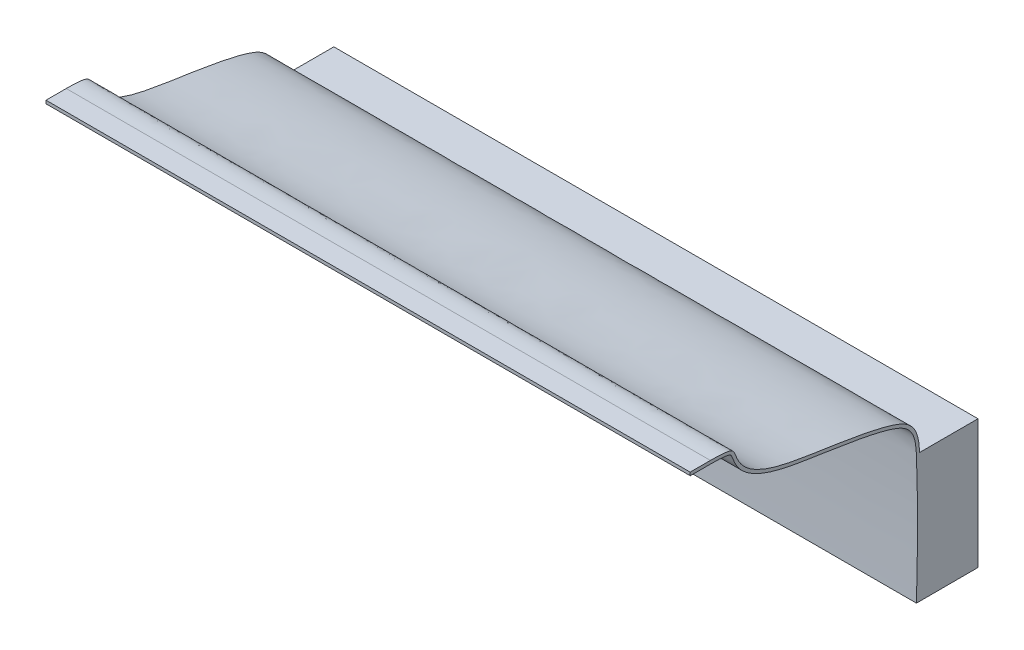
ISO-10303-21;
HEADER;
FILE_DESCRIPTION(('STEP AP214'),'2;1');
FILE_NAME('part.step','',(''),(''),'','','');
FILE_SCHEMA(('AUTOMOTIVE_DESIGN { 1 0 10303 214 1 1 1 1 }'));
ENDSEC;
DATA;
#1=APPLICATION_CONTEXT('core data for automotive mechanical design processes');
#2=APPLICATION_PROTOCOL_DEFINITION('international standard','automotive_design',2000,#1);
#3=PRODUCT_CONTEXT('',#1,'mechanical');
#4=PRODUCT('Part','Part','',(#3));
#5=PRODUCT_RELATED_PRODUCT_CATEGORY('part','',(#4));
#6=PRODUCT_DEFINITION_FORMATION('','',#4);
#7=PRODUCT_DEFINITION_CONTEXT('part definition',#1,'design');
#8=PRODUCT_DEFINITION('design','',#6,#7);
#9=PRODUCT_DEFINITION_SHAPE('','',#8);
#10=(LENGTH_UNIT() NAMED_UNIT(*) SI_UNIT(.MILLI.,.METRE.));
#11=(NAMED_UNIT(*) PLANE_ANGLE_UNIT() SI_UNIT($,.RADIAN.));
#12=(NAMED_UNIT(*) SI_UNIT($,.STERADIAN.) SOLID_ANGLE_UNIT());
#13=UNCERTAINTY_MEASURE_WITH_UNIT(LENGTH_MEASURE(1.E-05),#10,'distance_accuracy_value','');
#14=(GEOMETRIC_REPRESENTATION_CONTEXT(3) GLOBAL_UNCERTAINTY_ASSIGNED_CONTEXT((#13)) GLOBAL_UNIT_ASSIGNED_CONTEXT((#10,
#11,#12)) REPRESENTATION_CONTEXT('',''));
#15=CARTESIAN_POINT('',(0.,0.,0.));
#16=DIRECTION('',(0.,0.,1.));
#17=DIRECTION('',(1.,0.,0.));
#18=AXIS2_PLACEMENT_3D('',#15,#16,#17);
#19=CARTESIAN_POINT('',(-20.3320316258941,5.08,-2.3));
#20=DIRECTION('',(1.,0.,0.));
#21=DIRECTION('',(0.,0.,-1.));
#22=AXIS2_PLACEMENT_3D('',#19,#20,#21);
#23=PLANE('',#22);
#24=DIRECTION('',(0.,0.,1.));
#25=VECTOR('',#24,1.);
#26=CARTESIAN_POINT('',(-20.3320316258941,0.,-2.3));
#27=LINE('',#26,#25);
#28=CARTESIAN_POINT('',(-20.3320316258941,0.,-2.3));
#29=VERTEX_POINT('',#28);
#30=CARTESIAN_POINT('',(-20.3320316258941,-0.00216862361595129,-5.4829838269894E-05));
#31=VERTEX_POINT('',#30);
#32=EDGE_CURVE('E466',#29,#31,#27,.T.);
#33=ORIENTED_EDGE('',*,*,#32,.T.);
#34=CARTESIAN_POINT('',(-20.3320316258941,0.,0.));
#35=DIRECTION('',(0.,0.,1.));
#36=VECTOR('',#35,1.);
#37=LINE('',#34,#36);
#38=CARTESIAN_POINT('',(-20.3320316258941,-0.00444429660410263,0.126999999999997));
#39=VERTEX_POINT('',#38);
#40=EDGE_CURVE('E159',#31,#39,#37,.T.);
#41=ORIENTED_EDGE('',*,*,#40,.T.);
#42=CARTESIAN_POINT('',(-20.3320316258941,-0.00888859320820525,0.126999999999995));
#43=CARTESIAN_POINT('',(-20.3320316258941,1.04828765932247,0.100624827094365));
#44=CARTESIAN_POINT('',(-20.3320316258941,2.5980749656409,0.0619596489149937));
#45=CARTESIAN_POINT('',(-20.3320316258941,4.4512386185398,0.104012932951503));
#46=CARTESIAN_POINT('',(-20.3320316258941,5.11061033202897,0.128590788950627));
#47=CARTESIAN_POINT('',(-20.3320316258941,5.25979811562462,0.136443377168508));
#48=CARTESIAN_POINT('',(-20.3320316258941,5.48323742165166,0.162819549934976));
#49=CARTESIAN_POINT('',(-20.3320316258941,5.71146449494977,0.219765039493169));
#50=CARTESIAN_POINT('',(-20.3320316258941,5.89613270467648,0.302073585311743));
#51=CARTESIAN_POINT('',(-20.3320316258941,6.04656290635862,0.411828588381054));
#52=CARTESIAN_POINT('',(-20.3320316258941,6.17276414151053,0.554588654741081));
#53=CARTESIAN_POINT('',(-20.3320316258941,6.31363642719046,0.790668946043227));
#54=CARTESIAN_POINT('',(-20.3320316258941,6.4116182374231,1.05820065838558));
#55=CARTESIAN_POINT('',(-20.3320316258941,6.51958911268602,1.43653434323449));
#56=CARTESIAN_POINT('',(-20.3320316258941,6.62566805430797,1.87329890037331));
#57=CARTESIAN_POINT('',(-20.3320316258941,6.75146574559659,2.52942411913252));
#58=CARTESIAN_POINT('',(-20.3320316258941,6.86508798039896,3.22590130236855));
#59=CARTESIAN_POINT('',(-20.3320316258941,6.98973839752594,4.06547665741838));
#60=CARTESIAN_POINT('',(-20.3320316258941,7.1118509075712,4.86043553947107));
#61=CARTESIAN_POINT('',(-20.3320316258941,7.23328625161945,5.42840675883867));
#62=CARTESIAN_POINT('',(-20.3320316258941,7.32142250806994,5.77613720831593));
#63=CARTESIAN_POINT('',(-20.3320316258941,7.43374339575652,6.12919048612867));
#64=CARTESIAN_POINT('',(-20.3320316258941,7.59075244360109,6.48874219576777));
#65=CARTESIAN_POINT('',(-20.3320316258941,7.75779148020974,6.76888539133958));
#66=CARTESIAN_POINT('',(-20.3320316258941,7.93123039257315,6.98136442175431));
#67=CARTESIAN_POINT('',(-20.3320316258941,8.10668940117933,7.1373884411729));
#68=CARTESIAN_POINT('',(-20.3320316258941,8.26642460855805,7.24056093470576));
#69=CARTESIAN_POINT('',(-20.3320316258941,8.40707869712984,7.31079667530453));
#70=CARTESIAN_POINT('',(-20.3320316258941,8.52459324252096,7.36033679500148));
#71=CARTESIAN_POINT('',(-20.3320316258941,8.60685478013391,7.39269457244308));
#72=CARTESIAN_POINT('',(-20.3320316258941,8.66333806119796,7.41718960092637));
#73=CARTESIAN_POINT('',(-20.3320316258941,8.70628545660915,7.43583085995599));
#74=CARTESIAN_POINT('',(-20.3320316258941,8.74366529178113,7.48965231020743));
#75=CARTESIAN_POINT('',(-20.3320316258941,8.78171981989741,7.67142372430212));
#76=CARTESIAN_POINT('',(-20.3320316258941,8.80064792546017,7.89779483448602));
#77=CARTESIAN_POINT('',(-20.3320316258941,8.8055926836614,8.11617673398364));
#78=CARTESIAN_POINT('',(-20.3320316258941,8.805741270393,8.24476670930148));
#79=B_SPLINE_CURVE_WITH_KNOTS('',3,(#42,#43,#44,#45,#46,#47,#48,#49,#50,#51,#52,#53,#54,#55,#56,
#57,#58,#59,#60,#61,#62,#63,#64,#65,#66,#67,#68,#69,#70,#71,#72,#73,#74,#75,#76,#77,#78),
.UNSPECIFIED.,.F.,.F.,(4,1,2,1,1,1,1,1,1,1,1,1,1,1,1,1,1,1,1,1,1,1,1,1,1,1,1,1,1,1,1,1,1,4),(0.,
0.25,0.366492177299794,0.374999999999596,0.395833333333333,0.416666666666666,0.4375,
0.458333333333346,0.479166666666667,0.5,0.5392,0.546971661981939,0.5784,0.6176,0.64193063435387,
0.6638,0.71,0.725421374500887,0.733571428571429,0.757142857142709,0.780714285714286,
0.804285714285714,0.827857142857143,0.851428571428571,0.874999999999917,0.89375,0.9125,0.93125,
0.934791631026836,0.95,0.96875,0.979166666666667,0.989583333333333,1.),.UNSPECIFIED.);
#80=CARTESIAN_POINT('',(-20.3320316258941,8.80563656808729,8.24920977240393));
#81=VERTEX_POINT('',#80);
#82=EDGE_CURVE('E151',#39,#81,#79,.T.);
#83=ORIENTED_EDGE('',*,*,#82,.T.);
#84=CARTESIAN_POINT('',(-20.3320316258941,8.80563656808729,8.24920977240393));
#85=DIRECTION('',(0.,0.,1.));
#86=VECTOR('',#85,1.);
#87=LINE('',#84,#86);
#88=CARTESIAN_POINT('',(-20.3320316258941,8.80563656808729,9.04651660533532));
#89=VERTEX_POINT('',#88);
#90=EDGE_CURVE('E127',#81,#89,#87,.T.);
#91=ORIENTED_EDGE('',*,*,#90,.T.);
#92=CARTESIAN_POINT('',(-20.3320316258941,8.93249661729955,9.0539516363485));
#93=DIRECTION('',(-1.09273919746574E-13,-0.999722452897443,-0.023558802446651));
#94=VECTOR('',#93,1.);
#95=LINE('',#92,#94);
#96=CARTESIAN_POINT('',(-20.3320316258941,8.93260131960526,9.04950857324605));
#97=VERTEX_POINT('',#96);
#98=EDGE_CURVE('E389',#97,#89,#95,.T.);
#99=ORIENTED_EDGE('',*,*,#98,.F.);
#100=CARTESIAN_POINT('',(-20.3320316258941,8.93270602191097,8.25220174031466));
#101=DIRECTION('',(0.,0.,1.));
#102=VECTOR('',#101,1.);
#103=LINE('',#100,#102);
#104=CARTESIAN_POINT('',(-20.3320316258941,8.93260131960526,8.25220174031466));
#105=VERTEX_POINT('',#104);
#106=EDGE_CURVE('E142',#105,#97,#103,.T.);
#107=ORIENTED_EDGE('',*,*,#106,.F.);
#108=CARTESIAN_POINT('',(-20.3320316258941,-0.00888859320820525,0.));
#109=CARTESIAN_POINT('',(-20.3320316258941,1.05510279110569,-0.0256358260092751));
#110=CARTESIAN_POINT('',(-20.3320316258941,2.61488086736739,-0.0632171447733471));
#111=CARTESIAN_POINT('',(-20.3320316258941,4.44309453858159,-0.0246983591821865));
#112=CARTESIAN_POINT('',(-20.3320316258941,5.11990338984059,0.00184842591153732));
#113=CARTESIAN_POINT('',(-20.3320316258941,5.27362898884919,0.0102175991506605));
#114=CARTESIAN_POINT('',(-20.3320316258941,5.5076709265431,0.0378252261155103));
#115=CARTESIAN_POINT('',(-20.3320316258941,5.7544060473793,0.0995646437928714));
#116=CARTESIAN_POINT('',(-20.3320316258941,5.96223961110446,0.192440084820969));
#117=CARTESIAN_POINT('',(-20.3320316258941,6.13566146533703,0.319826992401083));
#118=CARTESIAN_POINT('',(-20.3320316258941,6.27881265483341,0.483339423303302));
#119=CARTESIAN_POINT('',(-20.3320316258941,6.43225875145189,0.742986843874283));
#120=CARTESIAN_POINT('',(-20.3320316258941,6.53341991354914,1.02189696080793));
#121=CARTESIAN_POINT('',(-20.3320316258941,6.64348961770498,1.40848267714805));
#122=CARTESIAN_POINT('',(-20.3320316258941,6.75056661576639,1.85007845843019));
#123=CARTESIAN_POINT('',(-20.3320316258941,6.87707340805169,2.51052128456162));
#124=CARTESIAN_POINT('',(-20.3320316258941,6.99103200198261,3.20962983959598));
#125=CARTESIAN_POINT('',(-20.3320316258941,7.11581204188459,4.05023704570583));
#126=CARTESIAN_POINT('',(-20.3320316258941,7.23773310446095,4.84271799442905));
#127=CARTESIAN_POINT('',(-20.3320316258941,7.35770683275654,5.40282235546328));
#128=CARTESIAN_POINT('',(-20.3320316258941,7.44439637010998,5.74413132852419));
#129=CARTESIAN_POINT('',(-20.3320316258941,7.55419334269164,6.08823422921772));
#130=CARTESIAN_POINT('',(-20.3320316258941,7.70588522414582,6.43435779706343));
#131=CARTESIAN_POINT('',(-20.3320316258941,7.8645284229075,6.69922084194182));
#132=CARTESIAN_POINT('',(-20.3320316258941,8.02595343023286,6.89592740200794));
#133=CARTESIAN_POINT('',(-20.3320316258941,8.18637070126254,7.03785277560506));
#134=CARTESIAN_POINT('',(-20.3320316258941,8.33217187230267,7.13154532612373));
#135=CARTESIAN_POINT('',(-20.3320316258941,8.46174605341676,7.19614235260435));
#136=CARTESIAN_POINT('',(-20.3320316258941,8.57657135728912,7.24425823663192));
#137=CARTESIAN_POINT('',(-20.3320316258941,8.65216022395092,7.27437625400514));
#138=CARTESIAN_POINT('',(-20.3320316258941,8.72408817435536,7.3045138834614));
#139=CARTESIAN_POINT('',(-20.3320316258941,8.79713003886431,7.33826330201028));
#140=CARTESIAN_POINT('',(-20.3320316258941,8.86959049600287,7.45784053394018));
#141=CARTESIAN_POINT('',(-20.3320316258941,8.90791459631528,7.65918621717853));
#142=CARTESIAN_POINT('',(-20.3320316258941,8.92780677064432,7.89568668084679));
#143=CARTESIAN_POINT('',(-20.3320316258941,8.93262213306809,8.11746866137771));
#144=CARTESIAN_POINT('',(-20.3320316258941,8.93270602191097,8.24775867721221));
#145=B_SPLINE_CURVE_WITH_KNOTS('',3,(#108,#109,#110,#111,#112,#113,#114,#115,#116,#117,#118,
#119,#120,#121,#122,#123,#124,#125,#126,#127,#128,#129,#130,#131,#132,#133,#134,#135,#136,#137,
#138,#139,#140,#141,#142,#143,#144),.UNSPECIFIED.,.F.,.F.,(4,1,2,1,1,1,1,1,1,1,1,1,1,1,1,1,1,1,
1,1,1,1,1,1,1,1,1,1,1,1,1,1,1,4),(0.,0.25,0.366492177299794,0.374999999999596,0.395833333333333,
0.416666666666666,0.4375,0.458333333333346,0.479166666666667,0.5,0.5392,0.546971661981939,
0.5784,0.6176,0.64193063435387,0.6638,0.71,0.725421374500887,0.733571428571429,
0.757142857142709,0.780714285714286,0.804285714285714,0.827857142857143,0.851428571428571,
0.874999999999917,0.89375,0.9125,0.93125,0.934791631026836,0.95,0.96875,0.979166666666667,
0.989583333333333,1.),.UNSPECIFIED.);
#146=CARTESIAN_POINT('',(-20.3320316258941,5.07277761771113,0.));
#147=VERTEX_POINT('',#146);
#148=EDGE_CURVE('E161',#147,#105,#145,.T.);
#149=ORIENTED_EDGE('',*,*,#148,.F.);
#150=DIRECTION('',(0.,-1.,0.));
#151=VECTOR('',#150,1.);
#152=CARTESIAN_POINT('',(-20.3320316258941,5.08,0.));
#153=LINE('',#152,#151);
#154=CARTESIAN_POINT('',(-20.3320316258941,5.08,0.));
#155=VERTEX_POINT('',#154);
#156=EDGE_CURVE('E12',#155,#147,#153,.T.);
#157=ORIENTED_EDGE('',*,*,#156,.F.);
#158=DIRECTION('',(0.,0.,1.));
#159=VECTOR('',#158,1.);
#160=CARTESIAN_POINT('',(-20.3320316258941,5.08,-2.3));
#161=LINE('',#160,#159);
#162=CARTESIAN_POINT('',(-20.3320316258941,5.08,-2.3));
#163=VERTEX_POINT('',#162);
#164=EDGE_CURVE('E488',#163,#155,#161,.T.);
#165=ORIENTED_EDGE('',*,*,#164,.F.);
#166=DIRECTION('',(0.,-1.,0.));
#167=VECTOR('',#166,1.);
#168=CARTESIAN_POINT('',(-20.3320316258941,5.08,-2.3));
#169=LINE('',#168,#167);
#170=EDGE_CURVE('E480',#163,#29,#169,.T.);
#171=ORIENTED_EDGE('',*,*,#170,.T.);
#172=EDGE_LOOP('',(#33,#41,#83,#91,#99,#107,#149,#157,#165,#171));
#173=FACE_BOUND('',#172,.T.);
#174=ADVANCED_FACE('F49',(#173),#23,.F.);
#175=CARTESIAN_POINT('',(-20.3320316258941,5.08,0.));
#176=DIRECTION('',(0.,0.,-1.));
#177=DIRECTION('',(-1.,0.,0.));
#178=AXIS2_PLACEMENT_3D('',#175,#176,#177);
#179=PLANE('',#178);
#180=ORIENTED_EDGE('',*,*,#156,.T.);
#181=DIRECTION('',(-1.,0.,0.));
#182=VECTOR('',#181,1.);
#183=CARTESIAN_POINT('',(-7.63203162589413,5.07277761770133,0.));
#184=LINE('',#183,#182);
#185=CARTESIAN_POINT('',(5.06796837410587,5.07277761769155,0.));
#186=VERTEX_POINT('',#185);
#187=EDGE_CURVE('E70',#147,#186,#184,.F.);
#188=ORIENTED_EDGE('',*,*,#187,.T.);
#189=DIRECTION('',(0.,-1.,0.));
#190=VECTOR('',#189,1.);
#191=CARTESIAN_POINT('',(5.06796837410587,5.08,0.));
#192=LINE('',#191,#190);
#193=CARTESIAN_POINT('',(5.06796837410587,5.08,0.));
#194=VERTEX_POINT('',#193);
#195=EDGE_CURVE('E60',#194,#186,#192,.T.);
#196=ORIENTED_EDGE('',*,*,#195,.F.);
#197=DIRECTION('',(1.,0.,0.));
#198=VECTOR('',#197,1.);
#199=CARTESIAN_POINT('',(-20.3320316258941,5.08,0.));
#200=LINE('',#199,#198);
#201=EDGE_CURVE('E486',#155,#194,#200,.T.);
#202=ORIENTED_EDGE('',*,*,#201,.F.);
#203=EDGE_LOOP('',(#180,#188,#196,#202));
#204=FACE_BOUND('',#203,.T.);
#205=ADVANCED_FACE('F371',(#204),#179,.F.);
#206=CARTESIAN_POINT('',(5.06796837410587,5.08,-2.3));
#207=DIRECTION('',(-1.,0.,0.));
#208=DIRECTION('',(0.,0.,1.));
#209=AXIS2_PLACEMENT_3D('',#206,#207,#208);
#210=PLANE('',#209);
#211=ORIENTED_EDGE('',*,*,#195,.T.);
#212=CARTESIAN_POINT('',(5.06796837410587,-0.00888859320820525,0.));
#213=CARTESIAN_POINT('',(5.06796837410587,1.05510279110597,-0.0256358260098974));
#214=CARTESIAN_POINT('',(5.06796837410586,2.61488086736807,-0.0632171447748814));
#215=CARTESIAN_POINT('',(5.06796837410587,4.44309453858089,-0.0246983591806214));
#216=CARTESIAN_POINT('',(5.06796837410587,5.11990338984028,0.00184842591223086));
#217=CARTESIAN_POINT('',(5.06796837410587,5.27362898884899,0.0102175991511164));
#218=CARTESIAN_POINT('',(5.06796837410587,5.50767092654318,0.0378252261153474));
#219=CARTESIAN_POINT('',(5.06796837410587,5.75440604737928,0.099564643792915));
#220=CARTESIAN_POINT('',(5.06796837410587,5.96223961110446,0.192440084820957));
#221=CARTESIAN_POINT('',(5.06796837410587,6.13566146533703,0.319826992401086));
#222=CARTESIAN_POINT('',(5.06796837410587,6.27881265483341,0.483339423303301));
#223=CARTESIAN_POINT('',(5.06796837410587,6.43225875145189,0.742986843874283));
#224=CARTESIAN_POINT('',(5.06796837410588,6.53341991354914,1.02189696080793));
#225=CARTESIAN_POINT('',(5.06796837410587,6.64348961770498,1.40848267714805));
#226=CARTESIAN_POINT('',(5.06796837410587,6.75056661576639,1.85007845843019));
#227=CARTESIAN_POINT('',(5.06796837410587,6.87707340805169,2.51052128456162));
#228=CARTESIAN_POINT('',(5.06796837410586,6.99103200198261,3.20962983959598));
#229=CARTESIAN_POINT('',(5.06796837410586,7.11581204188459,4.05023704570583));
#230=CARTESIAN_POINT('',(5.06796837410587,7.23773310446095,4.84271799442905));
#231=CARTESIAN_POINT('',(5.06796837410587,7.35770683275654,5.40282235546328));
#232=CARTESIAN_POINT('',(5.06796837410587,7.44439637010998,5.74413132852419));
#233=CARTESIAN_POINT('',(5.06796837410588,7.55419334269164,6.08823422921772));
#234=CARTESIAN_POINT('',(5.06796837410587,7.70588522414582,6.43435779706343));
#235=CARTESIAN_POINT('',(5.06796837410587,7.8645284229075,6.69922084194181));
#236=CARTESIAN_POINT('',(5.06796837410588,8.02595343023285,6.89592740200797));
#237=CARTESIAN_POINT('',(5.06796837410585,8.18637070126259,7.03785277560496));
#238=CARTESIAN_POINT('',(5.06796837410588,8.33217187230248,7.13154532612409));
#239=CARTESIAN_POINT('',(5.06796837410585,8.46174605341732,7.1961423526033));
#240=CARTESIAN_POINT('',(5.06796837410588,8.57657135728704,7.24425823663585));
#241=CARTESIAN_POINT('',(5.06796837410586,8.65216022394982,7.27437625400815));
#242=CARTESIAN_POINT('',(5.06796837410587,8.72408817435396,7.30451388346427));
#243=CARTESIAN_POINT('',(5.06796837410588,8.79713003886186,7.33826330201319));
#244=CARTESIAN_POINT('',(5.06796837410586,8.86959049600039,7.45784053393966));
#245=CARTESIAN_POINT('',(5.06796837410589,8.90791459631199,7.65918621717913));
#246=CARTESIAN_POINT('',(5.06796837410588,8.92780677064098,7.89568668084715));
#247=CARTESIAN_POINT('',(5.06796837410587,8.93262213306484,8.11746866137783));
#248=CARTESIAN_POINT('',(5.06796837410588,8.93270602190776,8.24775867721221));
#249=B_SPLINE_CURVE_WITH_KNOTS('',3,(#212,#213,#214,#215,#216,#217,#218,#219,#220,#221,#222,
#223,#224,#225,#226,#227,#228,#229,#230,#231,#232,#233,#234,#235,#236,#237,#238,#239,#240,#241,
#242,#243,#244,#245,#246,#247,#248),.UNSPECIFIED.,.F.,.F.,(4,1,2,1,1,1,1,1,1,1,1,1,1,1,1,1,1,1,
1,1,1,1,1,1,1,1,1,1,1,1,1,1,1,4),(0.,0.25,0.366492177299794,0.374999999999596,0.395833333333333,
0.416666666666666,0.4375,0.458333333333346,0.479166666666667,0.5,0.5392,0.546971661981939,
0.5784,0.6176,0.64193063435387,0.6638,0.71,0.725421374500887,0.733571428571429,
0.757142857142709,0.780714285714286,0.804285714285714,0.827857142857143,0.851428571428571,
0.874999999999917,0.89375,0.9125,0.93125,0.934791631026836,0.95,0.96875,0.979166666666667,
0.989583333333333,1.),.UNSPECIFIED.);
#250=CARTESIAN_POINT('',(5.06796837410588,8.93260131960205,8.25220174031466));
#251=VERTEX_POINT('',#250);
#252=EDGE_CURVE('E154',#186,#251,#249,.T.);
#253=ORIENTED_EDGE('',*,*,#252,.T.);
#254=CARTESIAN_POINT('',(5.06796837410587,8.93260131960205,8.25220174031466));
#255=DIRECTION('',(0.,0.,1.));
#256=VECTOR('',#255,1.);
#257=LINE('',#254,#256);
#258=CARTESIAN_POINT('',(5.06796837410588,8.93260131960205,9.04950857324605));
#259=VERTEX_POINT('',#258);
#260=EDGE_CURVE('E388',#251,#259,#257,.T.);
#261=ORIENTED_EDGE('',*,*,#260,.T.);
#262=CARTESIAN_POINT('',(5.06796837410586,8.80553186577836,9.05095966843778));
#263=DIRECTION('',(1.29762779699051E-13,0.999722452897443,0.0235588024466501));
#264=VECTOR('',#263,1.);
#265=LINE('',#262,#264);
#266=CARTESIAN_POINT('',(5.06796837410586,8.80563656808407,9.04651660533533));
#267=VERTEX_POINT('',#266);
#268=EDGE_CURVE('E163',#267,#259,#265,.T.);
#269=ORIENTED_EDGE('',*,*,#268,.F.);
#270=CARTESIAN_POINT('',(5.06796837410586,8.80574127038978,8.24920977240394));
#271=DIRECTION('',(0.,0.,1.));
#272=VECTOR('',#271,1.);
#273=LINE('',#270,#272);
#274=CARTESIAN_POINT('',(5.06796837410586,8.80563656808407,8.24920977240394));
#275=VERTEX_POINT('',#274);
#276=EDGE_CURVE('E143',#275,#267,#273,.T.);
#277=ORIENTED_EDGE('',*,*,#276,.F.);
#278=CARTESIAN_POINT('',(5.06796837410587,-0.00888859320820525,0.127000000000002));
#279=CARTESIAN_POINT('',(5.06796837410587,1.04828765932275,0.10062482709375));
#280=CARTESIAN_POINT('',(5.06796837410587,2.59807496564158,0.0619596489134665));
#281=CARTESIAN_POINT('',(5.06796837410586,4.45123861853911,0.104012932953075));
#282=CARTESIAN_POINT('',(5.06796837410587,5.11061033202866,0.128590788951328));
#283=CARTESIAN_POINT('',(5.06796837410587,5.25979811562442,0.136443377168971));
#284=CARTESIAN_POINT('',(5.06796837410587,5.48323742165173,0.162819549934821));
#285=CARTESIAN_POINT('',(5.06796837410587,5.71146449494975,0.219765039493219));
#286=CARTESIAN_POINT('',(5.06796837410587,5.89613270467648,0.302073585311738));
#287=CARTESIAN_POINT('',(5.06796837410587,6.04656290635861,0.411828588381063));
#288=CARTESIAN_POINT('',(5.06796837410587,6.17276414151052,0.554588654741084));
#289=CARTESIAN_POINT('',(5.06796837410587,6.31363642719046,0.79066894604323));
#290=CARTESIAN_POINT('',(5.06796837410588,6.41161823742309,1.05820065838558));
#291=CARTESIAN_POINT('',(5.06796837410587,6.51958911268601,1.43653434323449));
#292=CARTESIAN_POINT('',(5.06796837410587,6.62566805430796,1.87329890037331));
#293=CARTESIAN_POINT('',(5.06796837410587,6.75146574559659,2.52942411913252));
#294=CARTESIAN_POINT('',(5.06796837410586,6.86508798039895,3.22590130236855));
#295=CARTESIAN_POINT('',(5.06796837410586,6.98973839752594,4.06547665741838));
#296=CARTESIAN_POINT('',(5.06796837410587,7.11185090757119,4.86043553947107));
#297=CARTESIAN_POINT('',(5.06796837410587,7.23328625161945,5.42840675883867));
#298=CARTESIAN_POINT('',(5.06796837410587,7.32142250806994,5.77613720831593));
#299=CARTESIAN_POINT('',(5.06796837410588,7.43374339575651,6.12919048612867));
#300=CARTESIAN_POINT('',(5.06796837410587,7.59075244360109,6.48874219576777));
#301=CARTESIAN_POINT('',(5.06796837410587,7.75779148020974,6.76888539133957));
#302=CARTESIAN_POINT('',(5.06796837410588,7.93123039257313,6.98136442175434));
#303=CARTESIAN_POINT('',(5.06796837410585,8.10668940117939,7.1373884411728));
#304=CARTESIAN_POINT('',(5.06796837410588,8.26642460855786,7.24056093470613));
#305=CARTESIAN_POINT('',(5.06796837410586,8.4070786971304,7.31079667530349));
#306=CARTESIAN_POINT('',(5.06796837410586,8.52459324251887,7.36033679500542));
#307=CARTESIAN_POINT('',(5.06796837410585,8.60685478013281,7.3926945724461));
#308=CARTESIAN_POINT('',(5.06796837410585,8.66333806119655,7.41718960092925));
#309=CARTESIAN_POINT('',(5.06796837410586,8.70628545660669,7.43583085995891));
#310=CARTESIAN_POINT('',(5.06796837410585,8.74366529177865,7.48965231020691));
#311=CARTESIAN_POINT('',(5.06796837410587,8.78171981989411,7.67142372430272));
#312=CARTESIAN_POINT('',(5.06796837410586,8.80064792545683,7.89779483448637));
#313=CARTESIAN_POINT('',(5.06796837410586,8.80559268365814,8.11617673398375));
#314=CARTESIAN_POINT('',(5.06796837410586,8.80574127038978,8.24476670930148));
#315=B_SPLINE_CURVE_WITH_KNOTS('',3,(#278,#279,#280,#281,#282,#283,#284,#285,#286,#287,#288,
#289,#290,#291,#292,#293,#294,#295,#296,#297,#298,#299,#300,#301,#302,#303,#304,#305,#306,#307,
#308,#309,#310,#311,#312,#313,#314),.UNSPECIFIED.,.F.,.F.,(4,1,2,1,1,1,1,1,1,1,1,1,1,1,1,1,1,1,
1,1,1,1,1,1,1,1,1,1,1,1,1,1,1,4),(0.,0.25,0.366492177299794,0.374999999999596,0.395833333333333,
0.416666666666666,0.4375,0.458333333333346,0.479166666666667,0.5,0.5392,0.546971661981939,
0.5784,0.6176,0.64193063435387,0.6638,0.71,0.725421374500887,0.733571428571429,
0.757142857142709,0.780714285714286,0.804285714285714,0.827857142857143,0.851428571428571,
0.874999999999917,0.89375,0.9125,0.93125,0.934791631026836,0.95,0.96875,0.979166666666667,
0.989583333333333,1.),.UNSPECIFIED.);
#316=CARTESIAN_POINT('',(5.06796837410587,-0.00444429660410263,0.127000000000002));
#317=VERTEX_POINT('',#316);
#318=EDGE_CURVE('E153',#317,#275,#315,.T.);
#319=ORIENTED_EDGE('',*,*,#318,.F.);
#320=CARTESIAN_POINT('',(5.06796837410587,0.,0.127000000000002));
#321=DIRECTION('',(0.,0.,-1.));
#322=VECTOR('',#321,1.);
#323=LINE('',#320,#322);
#324=CARTESIAN_POINT('',(5.06796837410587,-0.00444429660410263,0.));
#325=VERTEX_POINT('',#324);
#326=EDGE_CURVE('E348',#317,#325,#323,.T.);
#327=ORIENTED_EDGE('',*,*,#326,.T.);
#328=DIRECTION('',(0.,0.,-1.));
#329=VECTOR('',#328,1.);
#330=CARTESIAN_POINT('',(5.06796837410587,0.,-2.3));
#331=LINE('',#330,#329);
#332=CARTESIAN_POINT('',(5.06796837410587,0.,-2.3));
#333=VERTEX_POINT('',#332);
#334=EDGE_CURVE('E353',#325,#333,#331,.T.);
#335=ORIENTED_EDGE('',*,*,#334,.T.);
#336=DIRECTION('',(0.,-1.,0.));
#337=VECTOR('',#336,1.);
#338=CARTESIAN_POINT('',(5.06796837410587,5.08,-2.3));
#339=LINE('',#338,#337);
#340=CARTESIAN_POINT('',(5.06796837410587,5.08,-2.3));
#341=VERTEX_POINT('',#340);
#342=EDGE_CURVE('E478',#341,#333,#339,.T.);
#343=ORIENTED_EDGE('',*,*,#342,.F.);
#344=DIRECTION('',(0.,0.,-1.));
#345=VECTOR('',#344,1.);
#346=CARTESIAN_POINT('',(5.06796837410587,5.08,-2.3));
#347=LINE('',#346,#345);
#348=EDGE_CURVE('E484',#194,#341,#347,.T.);
#349=ORIENTED_EDGE('',*,*,#348,.F.);
#350=EDGE_LOOP('',(#211,#253,#261,#269,#277,#319,#327,#335,#343,#349));
#351=FACE_BOUND('',#350,.T.);
#352=ADVANCED_FACE('F351',(#351),#210,.F.);
#353=CARTESIAN_POINT('',(-20.3320316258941,5.08,-2.3));
#354=DIRECTION('',(0.,0.,1.));
#355=DIRECTION('',(1.,0.,0.));
#356=AXIS2_PLACEMENT_3D('',#353,#354,#355);
#357=PLANE('',#356);
#358=DIRECTION('',(-1.,0.,0.));
#359=VECTOR('',#358,1.);
#360=CARTESIAN_POINT('',(-20.3320316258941,0.,-2.3));
#361=LINE('',#360,#359);
#362=EDGE_CURVE('E467',#333,#29,#361,.T.);
#363=ORIENTED_EDGE('',*,*,#362,.T.);
#364=ORIENTED_EDGE('',*,*,#170,.F.);
#365=DIRECTION('',(-1.,0.,0.));
#366=VECTOR('',#365,1.);
#367=CARTESIAN_POINT('',(-20.3320316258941,5.08,-2.3));
#368=LINE('',#367,#366);
#369=EDGE_CURVE('E482',#341,#163,#368,.T.);
#370=ORIENTED_EDGE('',*,*,#369,.F.);
#371=ORIENTED_EDGE('',*,*,#342,.T.);
#372=EDGE_LOOP('',(#363,#364,#370,#371));
#373=FACE_BOUND('',#372,.T.);
#374=ADVANCED_FACE('F370',(#373),#357,.F.);
#375=CARTESIAN_POINT('',(-20.3320316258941,5.08,-2.3));
#376=DIRECTION('',(0.,1.,0.));
#377=DIRECTION('',(0.,0.,1.));
#378=AXIS2_PLACEMENT_3D('',#375,#376,#377);
#379=PLANE('',#378);
#380=ORIENTED_EDGE('',*,*,#164,.T.);
#381=ORIENTED_EDGE('',*,*,#201,.T.);
#382=ORIENTED_EDGE('',*,*,#348,.T.);
#383=ORIENTED_EDGE('',*,*,#369,.T.);
#384=EDGE_LOOP('',(#380,#381,#382,#383));
#385=FACE_BOUND('',#384,.T.);
#386=ADVANCED_FACE('F444',(#385),#379,.T.);
#387=CARTESIAN_POINT('',(-20.3320316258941,0.,-2.3));
#388=DIRECTION('',(0.,1.,0.));
#389=DIRECTION('',(0.,0.,1.));
#390=AXIS2_PLACEMENT_3D('',#387,#388,#389);
#391=PLANE('',#390);
#392=ORIENTED_EDGE('',*,*,#32,.F.);
#393=ORIENTED_EDGE('',*,*,#362,.F.);
#394=ORIENTED_EDGE('',*,*,#334,.F.);
#395=ORIENTED_EDGE('',*,*,#326,.F.);
#396=CARTESIAN_POINT('',(-20.3320316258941,-0.00888859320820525,0.126999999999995));
#397=CARTESIAN_POINT('',(5.06796837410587,-0.00888859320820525,0.127000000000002));
#398=B_SPLINE_CURVE_WITH_KNOTS('',1,(#396,#397),.UNSPECIFIED.,.F.,.F.,(2,2),(0.502487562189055,
1.),.UNSPECIFIED.);
#399=EDGE_CURVE('E238',#39,#317,#398,.T.);
#400=ORIENTED_EDGE('',*,*,#399,.F.);
#401=ORIENTED_EDGE('',*,*,#40,.F.);
#402=EDGE_LOOP('',(#392,#393,#394,#395,#400,#401));
#403=FACE_BOUND('',#402,.T.);
#404=ADVANCED_FACE('F436',(#403),#391,.F.);
#405=CARTESIAN_POINT('',(5.06796837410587,-0.00888859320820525,0.));
#406=CARTESIAN_POINT('',(5.06796837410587,1.05510279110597,-0.0256358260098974));
#407=CARTESIAN_POINT('',(5.06796837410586,2.61488086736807,-0.0632171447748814));
#408=CARTESIAN_POINT('',(5.06796837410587,4.44309453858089,-0.0246983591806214));
#409=CARTESIAN_POINT('',(5.06796837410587,5.11990338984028,0.00184842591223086));
#410=CARTESIAN_POINT('',(5.06796837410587,5.27362898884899,0.0102175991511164));
#411=CARTESIAN_POINT('',(5.06796837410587,5.50767092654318,0.0378252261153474));
#412=CARTESIAN_POINT('',(5.06796837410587,5.75440604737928,0.099564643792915));
#413=CARTESIAN_POINT('',(5.06796837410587,5.96223961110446,0.192440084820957));
#414=CARTESIAN_POINT('',(5.06796837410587,6.13566146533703,0.319826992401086));
#415=CARTESIAN_POINT('',(5.06796837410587,6.27881265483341,0.483339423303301));
#416=CARTESIAN_POINT('',(5.06796837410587,6.43225875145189,0.742986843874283));
#417=CARTESIAN_POINT('',(5.06796837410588,6.53341991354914,1.02189696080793));
#418=CARTESIAN_POINT('',(5.06796837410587,6.64348961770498,1.40848267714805));
#419=CARTESIAN_POINT('',(5.06796837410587,6.75056661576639,1.85007845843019));
#420=CARTESIAN_POINT('',(5.06796837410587,6.87707340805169,2.51052128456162));
#421=CARTESIAN_POINT('',(5.06796837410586,6.99103200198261,3.20962983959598));
#422=CARTESIAN_POINT('',(5.06796837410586,7.11581204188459,4.05023704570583));
#423=CARTESIAN_POINT('',(5.06796837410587,7.23773310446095,4.84271799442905));
#424=CARTESIAN_POINT('',(5.06796837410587,7.35770683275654,5.40282235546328));
#425=CARTESIAN_POINT('',(5.06796837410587,7.44439637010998,5.74413132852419));
#426=CARTESIAN_POINT('',(5.06796837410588,7.55419334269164,6.08823422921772));
#427=CARTESIAN_POINT('',(5.06796837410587,7.70588522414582,6.43435779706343));
#428=CARTESIAN_POINT('',(5.06796837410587,7.8645284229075,6.69922084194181));
#429=CARTESIAN_POINT('',(5.06796837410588,8.02595343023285,6.89592740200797));
#430=CARTESIAN_POINT('',(5.06796837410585,8.18637070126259,7.03785277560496));
#431=CARTESIAN_POINT('',(5.06796837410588,8.33217187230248,7.13154532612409));
#432=CARTESIAN_POINT('',(5.06796837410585,8.46174605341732,7.1961423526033));
#433=CARTESIAN_POINT('',(5.06796837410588,8.57657135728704,7.24425823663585));
#434=CARTESIAN_POINT('',(5.06796837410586,8.65216022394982,7.27437625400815));
#435=CARTESIAN_POINT('',(5.06796837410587,8.72408817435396,7.30451388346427));
#436=CARTESIAN_POINT('',(5.06796837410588,8.79713003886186,7.33826330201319));
#437=CARTESIAN_POINT('',(5.06796837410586,8.86959049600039,7.45784053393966));
#438=CARTESIAN_POINT('',(5.06796837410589,8.90791459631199,7.65918621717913));
#439=CARTESIAN_POINT('',(5.06796837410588,8.92780677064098,7.89568668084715));
#440=CARTESIAN_POINT('',(5.06796837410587,8.93262213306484,8.11746866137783));
#441=CARTESIAN_POINT('',(5.06796837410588,8.93270602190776,8.24775867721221));
#442=CARTESIAN_POINT('',(-20.3320316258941,-0.00888859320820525,0.));
#443=CARTESIAN_POINT('',(-20.3320316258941,1.05510279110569,-0.0256358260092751));
#444=CARTESIAN_POINT('',(-20.3320316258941,2.61488086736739,-0.0632171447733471));
#445=CARTESIAN_POINT('',(-20.3320316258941,4.44309453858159,-0.0246983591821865));
#446=CARTESIAN_POINT('',(-20.3320316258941,5.11990338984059,0.00184842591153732));
#447=CARTESIAN_POINT('',(-20.3320316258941,5.27362898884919,0.0102175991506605));
#448=CARTESIAN_POINT('',(-20.3320316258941,5.5076709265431,0.0378252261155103));
#449=CARTESIAN_POINT('',(-20.3320316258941,5.7544060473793,0.0995646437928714));
#450=CARTESIAN_POINT('',(-20.3320316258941,5.96223961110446,0.192440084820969));
#451=CARTESIAN_POINT('',(-20.3320316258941,6.13566146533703,0.319826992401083));
#452=CARTESIAN_POINT('',(-20.3320316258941,6.27881265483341,0.483339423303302));
#453=CARTESIAN_POINT('',(-20.3320316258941,6.43225875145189,0.742986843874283));
#454=CARTESIAN_POINT('',(-20.3320316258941,6.53341991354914,1.02189696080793));
#455=CARTESIAN_POINT('',(-20.3320316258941,6.64348961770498,1.40848267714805));
#456=CARTESIAN_POINT('',(-20.3320316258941,6.75056661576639,1.85007845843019));
#457=CARTESIAN_POINT('',(-20.3320316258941,6.87707340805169,2.51052128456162));
#458=CARTESIAN_POINT('',(-20.3320316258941,6.99103200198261,3.20962983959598));
#459=CARTESIAN_POINT('',(-20.3320316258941,7.11581204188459,4.05023704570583));
#460=CARTESIAN_POINT('',(-20.3320316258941,7.23773310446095,4.84271799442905));
#461=CARTESIAN_POINT('',(-20.3320316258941,7.35770683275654,5.40282235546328));
#462=CARTESIAN_POINT('',(-20.3320316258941,7.44439637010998,5.74413132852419));
#463=CARTESIAN_POINT('',(-20.3320316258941,7.55419334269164,6.08823422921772));
#464=CARTESIAN_POINT('',(-20.3320316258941,7.70588522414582,6.43435779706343));
#465=CARTESIAN_POINT('',(-20.3320316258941,7.8645284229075,6.69922084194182));
#466=CARTESIAN_POINT('',(-20.3320316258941,8.02595343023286,6.89592740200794));
#467=CARTESIAN_POINT('',(-20.3320316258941,8.18637070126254,7.03785277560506));
#468=CARTESIAN_POINT('',(-20.3320316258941,8.33217187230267,7.13154532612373));
#469=CARTESIAN_POINT('',(-20.3320316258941,8.46174605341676,7.19614235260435));
#470=CARTESIAN_POINT('',(-20.3320316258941,8.57657135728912,7.24425823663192));
#471=CARTESIAN_POINT('',(-20.3320316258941,8.65216022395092,7.27437625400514));
#472=CARTESIAN_POINT('',(-20.3320316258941,8.72408817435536,7.3045138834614));
#473=CARTESIAN_POINT('',(-20.3320316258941,8.79713003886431,7.33826330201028));
#474=CARTESIAN_POINT('',(-20.3320316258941,8.86959049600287,7.45784053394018));
#475=CARTESIAN_POINT('',(-20.3320316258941,8.90791459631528,7.65918621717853));
#476=CARTESIAN_POINT('',(-20.3320316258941,8.92780677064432,7.89568668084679));
#477=CARTESIAN_POINT('',(-20.3320316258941,8.93262213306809,8.11746866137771));
#478=CARTESIAN_POINT('',(-20.3320316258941,8.93270602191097,8.24775867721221));
#479=B_SPLINE_SURFACE_WITH_KNOTS('',1,3,((#405,#406,#407,#408,#409,#410,#411,#412,#413,#414,
#415,#416,#417,#418,#419,#420,#421,#422,#423,#424,#425,#426,#427,#428,#429,#430,#431,#432,#433,
#434,#435,#436,#437,#438,#439,#440,#441),(#442,#443,#444,#445,#446,#447,#448,#449,#450,#451,
#452,#453,#454,#455,#456,#457,#458,#459,#460,#461,#462,#463,#464,#465,#466,#467,#468,#469,#470,
#471,#472,#473,#474,#475,#476,#477,#478)),.UNSPECIFIED.,.F.,.F.,.F.,(2,2),(4,1,2,1,1,1,1,1,1,1,
1,1,1,1,1,1,1,1,1,1,1,1,1,1,1,1,1,1,1,1,1,1,1,4),(0.00248756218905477,0.5),(0.,0.25,
0.366492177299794,0.374999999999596,0.395833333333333,0.416666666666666,0.4375,
0.458333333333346,0.479166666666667,0.5,0.5392,0.546971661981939,0.5784,0.6176,0.64193063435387,
0.6638,0.71,0.725421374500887,0.733571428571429,0.757142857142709,0.780714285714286,
0.804285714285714,0.827857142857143,0.851428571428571,0.874999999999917,0.89375,0.9125,0.93125,
0.934791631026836,0.95,0.96875,0.979166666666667,0.989583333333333,1.),.UNSPECIFIED.);
#480=CARTESIAN_POINT('',(-20.3320316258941,8.93270602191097,8.24775867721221));
#481=CARTESIAN_POINT('',(5.06796837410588,8.93270602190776,8.24775867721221));
#482=B_SPLINE_CURVE_WITH_KNOTS('',1,(#480,#481),.UNSPECIFIED.,.F.,.F.,(2,2),
(0.00248756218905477,0.5),.UNSPECIFIED.);
#483=EDGE_CURVE('E155',#251,#105,#482,.F.);
#484=ORIENTED_EDGE('',*,*,#187,.F.);
#485=ORIENTED_EDGE('',*,*,#148,.T.);
#486=ORIENTED_EDGE('',*,*,#483,.F.);
#487=ORIENTED_EDGE('',*,*,#252,.F.);
#488=EDGE_LOOP('',(#484,#485,#486,#487));
#489=FACE_BOUND('',#488,.T.);
#490=ADVANCED_FACE('F204',(#489),#479,.T.);
#491=CARTESIAN_POINT('',(-7.63203162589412,8.93270602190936,8.24775867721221));
#492=DIRECTION('',(1.26621154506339E-13,1.,0.));
#493=DIRECTION('',(-1.,1.26621154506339E-13,0.));
#494=AXIS2_PLACEMENT_3D('',#491,#492,#493);
#495=PLANE('',#494);
#496=ORIENTED_EDGE('',*,*,#483,.T.);
#497=ORIENTED_EDGE('',*,*,#106,.T.);
#498=CARTESIAN_POINT('',(5.06796837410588,8.93249661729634,9.0539516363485));
#499=DIRECTION('',(-1.,1.26552858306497E-13,0.));
#500=VECTOR('',#499,1.);
#501=LINE('',#498,#500);
#502=EDGE_CURVE('E320',#259,#97,#501,.T.);
#503=ORIENTED_EDGE('',*,*,#502,.F.);
#504=ORIENTED_EDGE('',*,*,#260,.F.);
#505=EDGE_LOOP('',(#496,#497,#503,#504));
#506=FACE_BOUND('',#505,.T.);
#507=ADVANCED_FACE('F263',(#506),#495,.T.);
#508=CARTESIAN_POINT('',(-7.63203162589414,8.80574127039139,8.24476670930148));
#509=DIRECTION('',(-1.26826043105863E-13,-1.,0.));
#510=DIRECTION('',(1.,-1.26826043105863E-13,0.));
#511=AXIS2_PLACEMENT_3D('',#508,#509,#510);
#512=PLANE('',#511);
#513=CARTESIAN_POINT('',(5.06796837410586,8.80574127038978,8.24476670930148));
#514=CARTESIAN_POINT('',(-20.3320316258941,8.805741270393,8.24476670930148));
#515=B_SPLINE_CURVE_WITH_KNOTS('',1,(#513,#514),.UNSPECIFIED.,.F.,.F.,(2,2),(0.502487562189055,
1.),.UNSPECIFIED.);
#516=EDGE_CURVE('E132',#81,#275,#515,.F.);
#517=ORIENTED_EDGE('',*,*,#516,.T.);
#518=ORIENTED_EDGE('',*,*,#276,.T.);
#519=CARTESIAN_POINT('',(-20.3320316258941,8.80553186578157,9.05095966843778));
#520=DIRECTION('',(1.,-1.26552858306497E-13,0.));
#521=VECTOR('',#520,1.);
#522=LINE('',#519,#521);
#523=EDGE_CURVE('E136',#89,#267,#522,.T.);
#524=ORIENTED_EDGE('',*,*,#523,.F.);
#525=ORIENTED_EDGE('',*,*,#90,.F.);
#526=EDGE_LOOP('',(#517,#518,#524,#525));
#527=FACE_BOUND('',#526,.T.);
#528=ADVANCED_FACE('F130',(#527),#512,.T.);
#529=CARTESIAN_POINT('',(5.06796837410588,8.93249661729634,9.0539516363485));
#530=DIRECTION('',(0.,0.0235588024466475,-0.999722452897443));
#531=DIRECTION('',(1.26537705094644E-13,0.999722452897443,0.0235588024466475));
#532=AXIS2_PLACEMENT_3D('',#529,#530,#531);
#533=PLANE('',#532);
#534=ORIENTED_EDGE('',*,*,#268,.T.);
#535=ORIENTED_EDGE('',*,*,#502,.T.);
#536=ORIENTED_EDGE('',*,*,#98,.T.);
#537=ORIENTED_EDGE('',*,*,#523,.T.);
#538=EDGE_LOOP('',(#534,#535,#536,#537));
#539=FACE_BOUND('',#538,.T.);
#540=ADVANCED_FACE('F195',(#539),#533,.F.);
#541=CARTESIAN_POINT('',(-20.3320316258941,-0.00888859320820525,0.126999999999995));
#542=CARTESIAN_POINT('',(-20.3320316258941,1.04828765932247,0.100624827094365));
#543=CARTESIAN_POINT('',(-20.3320316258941,2.5980749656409,0.0619596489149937));
#544=CARTESIAN_POINT('',(-20.3320316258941,4.4512386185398,0.104012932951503));
#545=CARTESIAN_POINT('',(-20.3320316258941,5.11061033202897,0.128590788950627));
#546=CARTESIAN_POINT('',(-20.3320316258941,5.25979811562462,0.136443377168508));
#547=CARTESIAN_POINT('',(-20.3320316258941,5.48323742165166,0.162819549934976));
#548=CARTESIAN_POINT('',(-20.3320316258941,5.71146449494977,0.219765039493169));
#549=CARTESIAN_POINT('',(-20.3320316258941,5.89613270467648,0.302073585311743));
#550=CARTESIAN_POINT('',(-20.3320316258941,6.04656290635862,0.411828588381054));
#551=CARTESIAN_POINT('',(-20.3320316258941,6.17276414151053,0.554588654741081));
#552=CARTESIAN_POINT('',(-20.3320316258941,6.31363642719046,0.790668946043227));
#553=CARTESIAN_POINT('',(-20.3320316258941,6.4116182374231,1.05820065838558));
#554=CARTESIAN_POINT('',(-20.3320316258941,6.51958911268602,1.43653434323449));
#555=CARTESIAN_POINT('',(-20.3320316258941,6.62566805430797,1.87329890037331));
#556=CARTESIAN_POINT('',(-20.3320316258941,6.75146574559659,2.52942411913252));
#557=CARTESIAN_POINT('',(-20.3320316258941,6.86508798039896,3.22590130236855));
#558=CARTESIAN_POINT('',(-20.3320316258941,6.98973839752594,4.06547665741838));
#559=CARTESIAN_POINT('',(-20.3320316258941,7.1118509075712,4.86043553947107));
#560=CARTESIAN_POINT('',(-20.3320316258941,7.23328625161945,5.42840675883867));
#561=CARTESIAN_POINT('',(-20.3320316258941,7.32142250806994,5.77613720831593));
#562=CARTESIAN_POINT('',(-20.3320316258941,7.43374339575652,6.12919048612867));
#563=CARTESIAN_POINT('',(-20.3320316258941,7.59075244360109,6.48874219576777));
#564=CARTESIAN_POINT('',(-20.3320316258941,7.75779148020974,6.76888539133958));
#565=CARTESIAN_POINT('',(-20.3320316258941,7.93123039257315,6.98136442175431));
#566=CARTESIAN_POINT('',(-20.3320316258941,8.10668940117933,7.1373884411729));
#567=CARTESIAN_POINT('',(-20.3320316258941,8.26642460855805,7.24056093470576));
#568=CARTESIAN_POINT('',(-20.3320316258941,8.40707869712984,7.31079667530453));
#569=CARTESIAN_POINT('',(-20.3320316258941,8.52459324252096,7.36033679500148));
#570=CARTESIAN_POINT('',(-20.3320316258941,8.60685478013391,7.39269457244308));
#571=CARTESIAN_POINT('',(-20.3320316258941,8.66333806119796,7.41718960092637));
#572=CARTESIAN_POINT('',(-20.3320316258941,8.70628545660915,7.43583085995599));
#573=CARTESIAN_POINT('',(-20.3320316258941,8.74366529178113,7.48965231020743));
#574=CARTESIAN_POINT('',(-20.3320316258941,8.78171981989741,7.67142372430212));
#575=CARTESIAN_POINT('',(-20.3320316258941,8.80064792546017,7.89779483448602));
#576=CARTESIAN_POINT('',(-20.3320316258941,8.8055926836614,8.11617673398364));
#577=CARTESIAN_POINT('',(-20.3320316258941,8.805741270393,8.24476670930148));
#578=CARTESIAN_POINT('',(5.06796837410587,-0.00888859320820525,0.127000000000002));
#579=CARTESIAN_POINT('',(5.06796837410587,1.04828765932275,0.10062482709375));
#580=CARTESIAN_POINT('',(5.06796837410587,2.59807496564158,0.0619596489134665));
#581=CARTESIAN_POINT('',(5.06796837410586,4.45123861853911,0.104012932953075));
#582=CARTESIAN_POINT('',(5.06796837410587,5.11061033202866,0.128590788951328));
#583=CARTESIAN_POINT('',(5.06796837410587,5.25979811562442,0.136443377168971));
#584=CARTESIAN_POINT('',(5.06796837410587,5.48323742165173,0.162819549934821));
#585=CARTESIAN_POINT('',(5.06796837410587,5.71146449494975,0.219765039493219));
#586=CARTESIAN_POINT('',(5.06796837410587,5.89613270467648,0.302073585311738));
#587=CARTESIAN_POINT('',(5.06796837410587,6.04656290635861,0.411828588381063));
#588=CARTESIAN_POINT('',(5.06796837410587,6.17276414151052,0.554588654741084));
#589=CARTESIAN_POINT('',(5.06796837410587,6.31363642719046,0.79066894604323));
#590=CARTESIAN_POINT('',(5.06796837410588,6.41161823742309,1.05820065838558));
#591=CARTESIAN_POINT('',(5.06796837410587,6.51958911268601,1.43653434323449));
#592=CARTESIAN_POINT('',(5.06796837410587,6.62566805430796,1.87329890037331));
#593=CARTESIAN_POINT('',(5.06796837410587,6.75146574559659,2.52942411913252));
#594=CARTESIAN_POINT('',(5.06796837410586,6.86508798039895,3.22590130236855));
#595=CARTESIAN_POINT('',(5.06796837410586,6.98973839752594,4.06547665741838));
#596=CARTESIAN_POINT('',(5.06796837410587,7.11185090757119,4.86043553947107));
#597=CARTESIAN_POINT('',(5.06796837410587,7.23328625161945,5.42840675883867));
#598=CARTESIAN_POINT('',(5.06796837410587,7.32142250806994,5.77613720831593));
#599=CARTESIAN_POINT('',(5.06796837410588,7.43374339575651,6.12919048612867));
#600=CARTESIAN_POINT('',(5.06796837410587,7.59075244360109,6.48874219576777));
#601=CARTESIAN_POINT('',(5.06796837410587,7.75779148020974,6.76888539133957));
#602=CARTESIAN_POINT('',(5.06796837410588,7.93123039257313,6.98136442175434));
#603=CARTESIAN_POINT('',(5.06796837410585,8.10668940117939,7.1373884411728));
#604=CARTESIAN_POINT('',(5.06796837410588,8.26642460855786,7.24056093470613));
#605=CARTESIAN_POINT('',(5.06796837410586,8.4070786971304,7.31079667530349));
#606=CARTESIAN_POINT('',(5.06796837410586,8.52459324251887,7.36033679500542));
#607=CARTESIAN_POINT('',(5.06796837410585,8.60685478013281,7.3926945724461));
#608=CARTESIAN_POINT('',(5.06796837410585,8.66333806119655,7.41718960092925));
#609=CARTESIAN_POINT('',(5.06796837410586,8.70628545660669,7.43583085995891));
#610=CARTESIAN_POINT('',(5.06796837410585,8.74366529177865,7.48965231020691));
#611=CARTESIAN_POINT('',(5.06796837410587,8.78171981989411,7.67142372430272));
#612=CARTESIAN_POINT('',(5.06796837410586,8.80064792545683,7.89779483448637));
#613=CARTESIAN_POINT('',(5.06796837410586,8.80559268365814,8.11617673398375));
#614=CARTESIAN_POINT('',(5.06796837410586,8.80574127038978,8.24476670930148));
#615=B_SPLINE_SURFACE_WITH_KNOTS('',1,3,((#541,#542,#543,#544,#545,#546,#547,#548,#549,#550,
#551,#552,#553,#554,#555,#556,#557,#558,#559,#560,#561,#562,#563,#564,#565,#566,#567,#568,#569,
#570,#571,#572,#573,#574,#575,#576,#577),(#578,#579,#580,#581,#582,#583,#584,#585,#586,#587,
#588,#589,#590,#591,#592,#593,#594,#595,#596,#597,#598,#599,#600,#601,#602,#603,#604,#605,#606,
#607,#608,#609,#610,#611,#612,#613,#614)),.UNSPECIFIED.,.F.,.F.,.F.,(2,2),(4,1,2,1,1,1,1,1,1,1,
1,1,1,1,1,1,1,1,1,1,1,1,1,1,1,1,1,1,1,1,1,1,1,4),(0.502487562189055,1.),(0.,0.25,
0.366492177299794,0.374999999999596,0.395833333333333,0.416666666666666,0.4375,
0.458333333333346,0.479166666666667,0.5,0.5392,0.546971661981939,0.5784,0.6176,0.64193063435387,
0.6638,0.71,0.725421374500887,0.733571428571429,0.757142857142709,0.780714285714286,
0.804285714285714,0.827857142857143,0.851428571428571,0.874999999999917,0.89375,0.9125,0.93125,
0.934791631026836,0.95,0.96875,0.979166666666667,0.989583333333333,1.),.UNSPECIFIED.);
#616=ORIENTED_EDGE('',*,*,#399,.T.);
#617=ORIENTED_EDGE('',*,*,#318,.T.);
#618=ORIENTED_EDGE('',*,*,#516,.F.);
#619=ORIENTED_EDGE('',*,*,#82,.F.);
#620=EDGE_LOOP('',(#616,#617,#618,#619));
#621=FACE_BOUND('',#620,.T.);
#622=ADVANCED_FACE('F150',(#621),#615,.T.);
#623=CLOSED_SHELL('',(#174,#205,#352,#374,#386,#404,#490,#507,#528,#540,#622));
#624=MANIFOLD_SOLID_BREP('B2',#623);
#625=ADVANCED_BREP_SHAPE_REPRESENTATION('',(#18,#624),#14);
#626=SHAPE_DEFINITION_REPRESENTATION(#9,#625);
ENDSEC;
END-ISO-10303-21;
